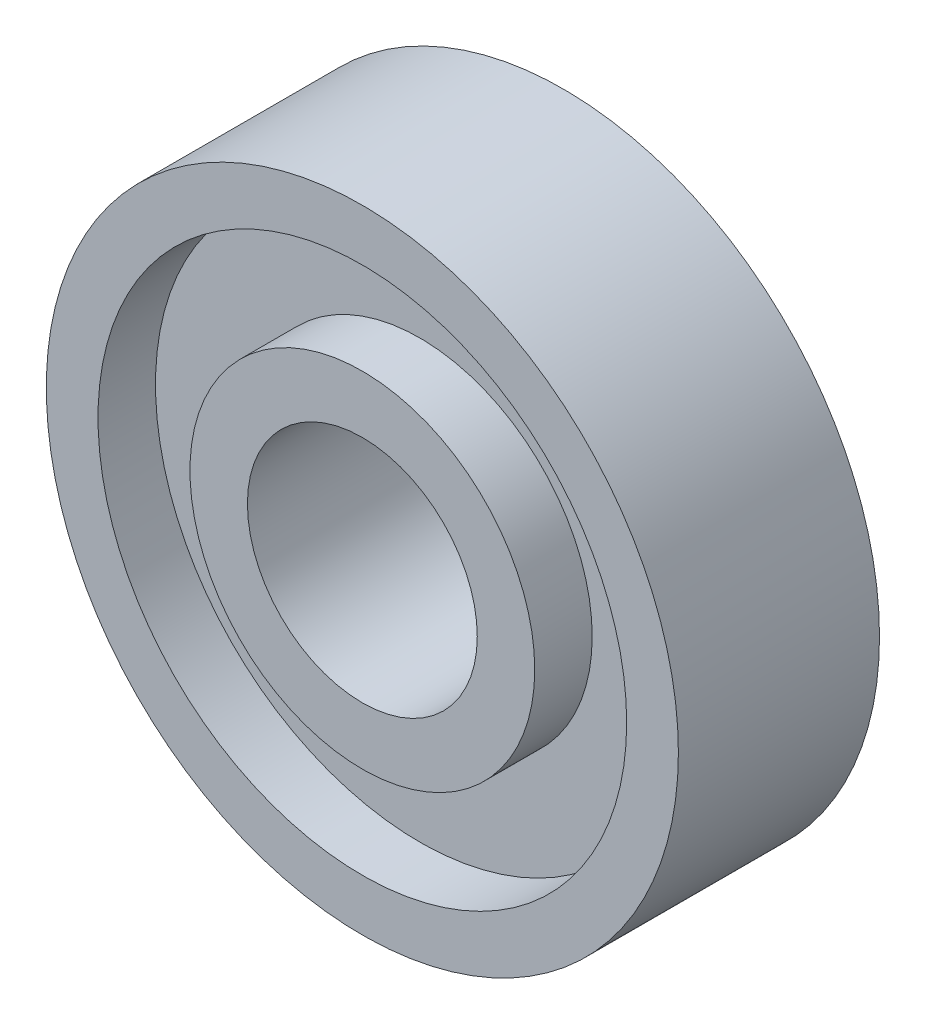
from build123d import *

# Parameters (mm, degrees)
SKETCH1_R           = 11
BOSS_EXTRUDE1_DEPTH = 3.5
SKETCH2_R           = 9.2
SKETCH2_R_2         = 6
CUT_EXTRUDE1_DEPTH  = 2
SKETCH3_R           = 4
CUT_EXTRUDE2_DEPTH  = 18.058722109


with BuildPart() as part:
    # Sketch1 → Boss-Extrude1 (new, symmetric)
    with BuildSketch(Plane.XY):
        Circle(SKETCH1_R)
    extrude(amount=BOSS_EXTRUDE1_DEPTH, both=True)

    # Sketch2 → Cut-Extrude1 (cut)
    with BuildSketch(Plane.XY.offset(3.5)):
        Circle(SKETCH2_R)
        Circle(SKETCH2_R_2, mode=Mode.SUBTRACT)
    cut_extrude1 = extrude(amount=-CUT_EXTRUDE1_DEPTH, mode=Mode.SUBTRACT)

    # Mirror1: Cut-Extrude1 across plane
    add(cut_extrude1.mirror(Plane.XY), mode=Mode.SUBTRACT)

    # Sketch3 → Cut-Extrude2 (cut, through all)
    with BuildSketch(Plane.XY.offset(3.5)):
        Circle(SKETCH3_R)
    extrude(amount=-CUT_EXTRUDE2_DEPTH, mode=Mode.SUBTRACT)


solid = part.part
